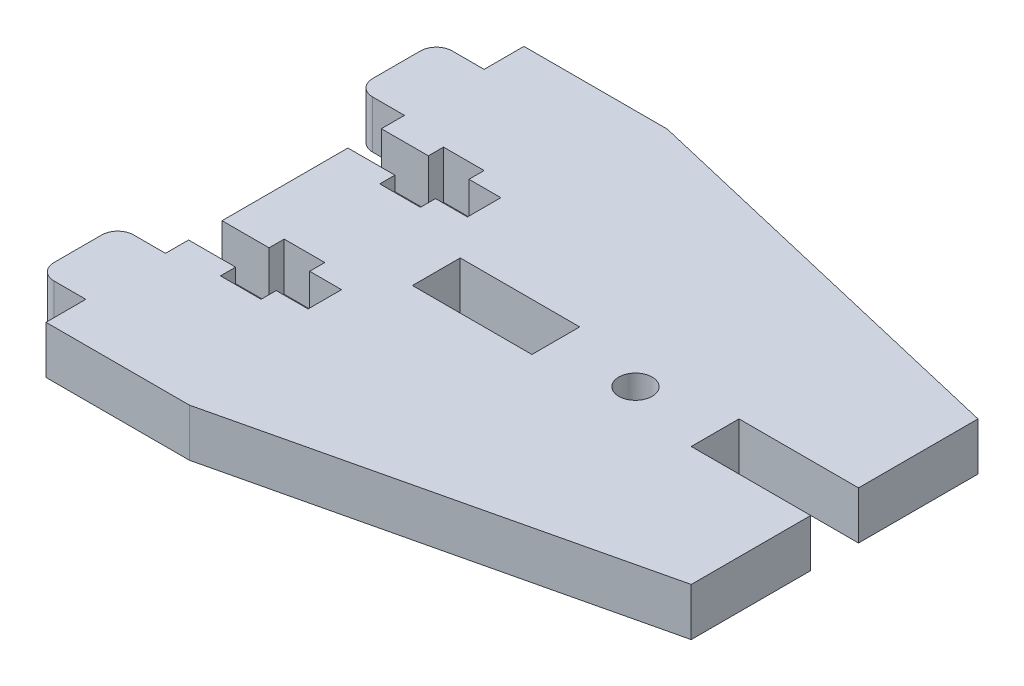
from build123d import *

# Parameters (mm, degrees)
SKETCH_1_R      = 2.1
SKETCH_1_W      = 15
SKETCH_1_H      = 6
EXTRUDE_1_DEPTH = 6


with BuildPart() as part:
    # Sketch 1 → Extrude 1 (new body)
    # profile 1 of 3: a face of its own
    with BuildSketch(Plane(origin=(0, 0, 0), x_dir=(1, 0, 0), z_dir=(0, 1, 0))):
        with BuildLine():
            Line((-4, 5), (0, 5))
            Line((0, 5), (0, 15))
            Line((0, 15), (-4, 15))
            ThreePointArc((-4, 15), (-5.414213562, 14.414213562), (-6, 13))
            Line((-6, 13), (-6, 7))
            ThreePointArc((-6, 7), (-5.414213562, 5.585786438), (-4, 5))
        make_face()
    # profile 2 of 3: a face of its own
    with BuildSketch(Plane(origin=(0, 0, 0), x_dir=(1, 0, 0), z_dir=(0, 1, 0))):
        with BuildLine():
            Line((0, 45), (0, 55))
            Line((0, 55), (-4, 55))
            ThreePointArc((-4, 55), (-5.414213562, 54.414213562), (-6, 53))
            Line((-6, 53), (-6, 47))
            ThreePointArc((-6, 47), (-5.414213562, 45.585786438), (-4, 45))
            Line((-4, 45), (0, 45))
        make_face()
    # profile 3 of 3: a face of its own
    with BuildSketch(Plane(origin=(0, 0, 0), x_dir=(1, 0, 0), z_dir=(0, 1, 0))):
        Polygon((69, 48), (18, 60), (0, 60), (0, 55), (0, 45), (0, 42.1), (5.9, 42.1), (5.9, 44), (11, 44), (11, 42.1), (15, 42.1), (15, 37.9), (11, 37.9), (11, 36), (5.9, 36), (5.9, 37.9), (0, 37.9), (0, 22.1), (5.9, 22.1), (5.9, 24), (11, 24), (11, 22.1), (15, 22.1), (15, 17.9), (11, 17.9), (11, 16), (5.9, 16), (5.9, 17.9), (0, 17.9), (0, 15), (0, 5), (0, 0), (18, 0), (69, 12), (69, 27), (54, 27), (54, 33), (69, 33), align=None)
        with Locations(Location((44, 30, 0), (0, 0, 270))):
            Circle(SKETCH_1_R, mode=Mode.SUBTRACT)
        with Locations((26.5, 30)):
            Rectangle(SKETCH_1_W, SKETCH_1_H, mode=Mode.SUBTRACT)
    extrude(amount=EXTRUDE_1_DEPTH)


solid = part.part
